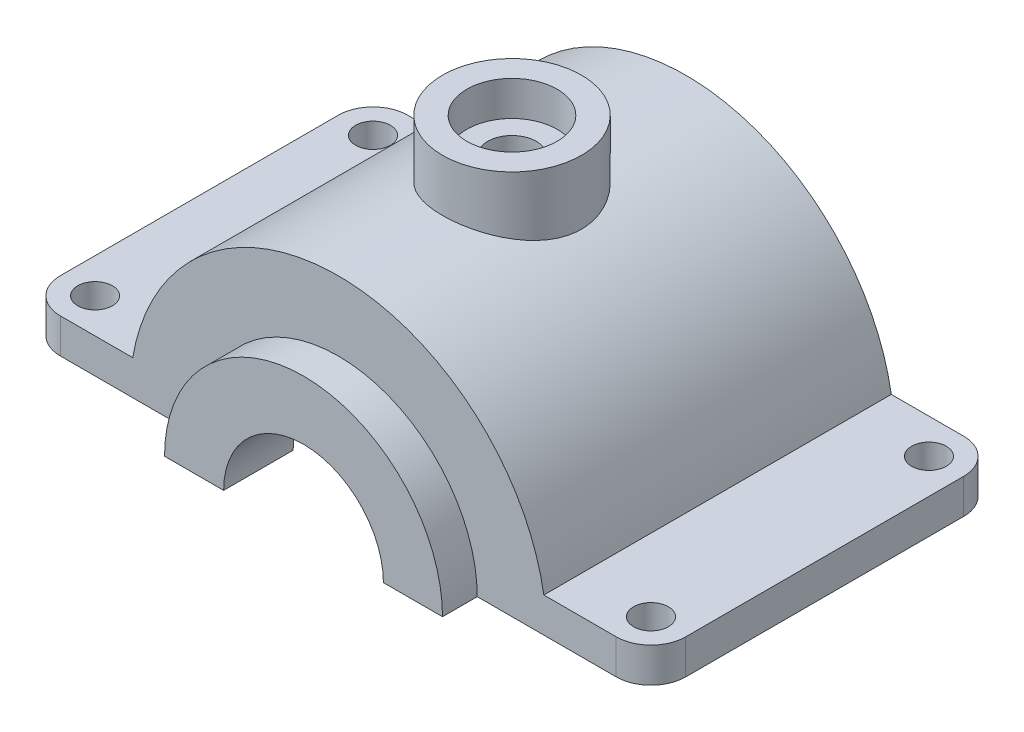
ISO-10303-21;
HEADER;
FILE_DESCRIPTION(('STEP AP214'),'2;1');
FILE_NAME('part.step','',(''),(''),'','','');
FILE_SCHEMA(('AUTOMOTIVE_DESIGN { 1 0 10303 214 1 1 1 1 }'));
ENDSEC;
DATA;
#1=APPLICATION_CONTEXT('core data for automotive mechanical design processes');
#2=APPLICATION_PROTOCOL_DEFINITION('international standard','automotive_design',2000,#1);
#3=PRODUCT_CONTEXT('',#1,'mechanical');
#4=PRODUCT('Part','Part','',(#3));
#5=PRODUCT_RELATED_PRODUCT_CATEGORY('part','',(#4));
#6=PRODUCT_DEFINITION_FORMATION('','',#4);
#7=PRODUCT_DEFINITION_CONTEXT('part definition',#1,'design');
#8=PRODUCT_DEFINITION('design','',#6,#7);
#9=PRODUCT_DEFINITION_SHAPE('','',#8);
#10=(LENGTH_UNIT() NAMED_UNIT(*) SI_UNIT(.MILLI.,.METRE.));
#11=(NAMED_UNIT(*) PLANE_ANGLE_UNIT() SI_UNIT($,.RADIAN.));
#12=(NAMED_UNIT(*) SI_UNIT($,.STERADIAN.) SOLID_ANGLE_UNIT());
#13=UNCERTAINTY_MEASURE_WITH_UNIT(LENGTH_MEASURE(1.E-05),#10,'distance_accuracy_value','');
#14=(GEOMETRIC_REPRESENTATION_CONTEXT(3) GLOBAL_UNCERTAINTY_ASSIGNED_CONTEXT((#13)) GLOBAL_UNIT_ASSIGNED_CONTEXT((#10,
#11,#12)) REPRESENTATION_CONTEXT('',''));
#15=CARTESIAN_POINT('',(0.,0.,0.));
#16=DIRECTION('',(0.,0.,1.));
#17=DIRECTION('',(1.,0.,0.));
#18=AXIS2_PLACEMENT_3D('',#15,#16,#17);
#19=CARTESIAN_POINT('',(-59.1607978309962,10.,40.));
#20=DIRECTION('',(0.,-1.,0.));
#21=DIRECTION('',(1.,0.,0.));
#22=AXIS2_PLACEMENT_3D('',#19,#20,#21);
#23=PLANE('',#22);
#24=CARTESIAN_POINT('',(-80.,10.,-40.));
#25=DIRECTION('',(0.,-1.,0.));
#26=DIRECTION('',(0.,0.,1.));
#27=AXIS2_PLACEMENT_3D('',#24,#25,#26);
#28=CIRCLE('',#27,5.00000000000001);
#29=CARTESIAN_POINT('',(-80.,10.,-35.));
#30=VERTEX_POINT('',#29);
#31=EDGE_CURVE('E522',#30,#30,#28,.T.);
#32=ORIENTED_EDGE('',*,*,#31,.T.);
#33=EDGE_LOOP('',(#32));
#34=FACE_BOUND('',#33,.T.);
#35=DIRECTION('',(0.,0.,-1.));
#36=VECTOR('',#35,1.);
#37=CARTESIAN_POINT('',(-90.,10.,40.));
#38=LINE('',#37,#36);
#39=CARTESIAN_POINT('',(-90.,10.,40.));
#40=VERTEX_POINT('',#39);
#41=CARTESIAN_POINT('',(-90.,10.,-40.));
#42=VERTEX_POINT('',#41);
#43=EDGE_CURVE('E325',#40,#42,#38,.T.);
#44=ORIENTED_EDGE('',*,*,#43,.F.);
#45=CARTESIAN_POINT('',(-80.,10.,40.));
#46=DIRECTION('',(0.,-1.,0.));
#47=DIRECTION('',(1.,0.,0.));
#48=AXIS2_PLACEMENT_3D('',#45,#46,#47);
#49=CIRCLE('',#48,10.);
#50=CARTESIAN_POINT('',(-80.,10.,50.));
#51=VERTEX_POINT('',#50);
#52=EDGE_CURVE('E235',#40,#51,#49,.F.);
#53=ORIENTED_EDGE('',*,*,#52,.T.);
#54=DIRECTION('',(-1.,0.,0.));
#55=VECTOR('',#54,1.);
#56=CARTESIAN_POINT('',(-59.1607978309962,10.,50.));
#57=LINE('',#56,#55);
#58=CARTESIAN_POINT('',(-59.1607978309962,10.,50.));
#59=VERTEX_POINT('',#58);
#60=EDGE_CURVE('E196',#59,#51,#57,.T.);
#61=ORIENTED_EDGE('',*,*,#60,.F.);
#62=DIRECTION('',(0.,0.,-1.));
#63=VECTOR('',#62,1.);
#64=CARTESIAN_POINT('',(-59.1607978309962,10.,40.));
#65=LINE('',#64,#63);
#66=CARTESIAN_POINT('',(-59.1607978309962,10.,-50.));
#67=VERTEX_POINT('',#66);
#68=EDGE_CURVE('E258',#59,#67,#65,.T.);
#69=ORIENTED_EDGE('',*,*,#68,.T.);
#70=DIRECTION('',(-1.,0.,0.));
#71=VECTOR('',#70,1.);
#72=CARTESIAN_POINT('',(-59.1607978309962,10.,-50.));
#73=LINE('',#72,#71);
#74=CARTESIAN_POINT('',(-80.,10.,-50.));
#75=VERTEX_POINT('',#74);
#76=EDGE_CURVE('E269',#67,#75,#73,.T.);
#77=ORIENTED_EDGE('',*,*,#76,.T.);
#78=CARTESIAN_POINT('',(-80.,10.,-40.));
#79=DIRECTION('',(0.,-1.,0.));
#80=DIRECTION('',(1.,0.,0.));
#81=AXIS2_PLACEMENT_3D('',#78,#79,#80);
#82=CIRCLE('',#81,10.);
#83=EDGE_CURVE('E233',#75,#42,#82,.F.);
#84=ORIENTED_EDGE('',*,*,#83,.T.);
#85=EDGE_LOOP('',(#44,#53,#61,#69,#77,#84));
#86=FACE_BOUND('',#85,.T.);
#87=CARTESIAN_POINT('',(-80.,10.,40.));
#88=DIRECTION('',(0.,-1.,0.));
#89=DIRECTION('',(0.,0.,1.));
#90=AXIS2_PLACEMENT_3D('',#87,#88,#89);
#91=CIRCLE('',#90,5.00000000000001);
#92=CARTESIAN_POINT('',(-80.,10.,45.));
#93=VERTEX_POINT('',#92);
#94=EDGE_CURVE('E527',#93,#93,#91,.T.);
#95=ORIENTED_EDGE('',*,*,#94,.T.);
#96=EDGE_LOOP('',(#95));
#97=FACE_BOUND('',#96,.T.);
#98=ADVANCED_FACE('F31',(#34,#86,#97),#23,.F.);
#99=CARTESIAN_POINT('',(-90.,0.,40.));
#100=DIRECTION('',(0.,1.,0.));
#101=DIRECTION('',(0.,0.,1.));
#102=AXIS2_PLACEMENT_3D('',#99,#100,#101);
#103=PLANE('',#102);
#104=CARTESIAN_POINT('',(-80.,0.,-40.));
#105=DIRECTION('',(0.,-1.,0.));
#106=DIRECTION('',(0.,0.,1.));
#107=AXIS2_PLACEMENT_3D('',#104,#105,#106);
#108=CIRCLE('',#107,5.00000000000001);
#109=CARTESIAN_POINT('',(-80.,0.,-35.));
#110=VERTEX_POINT('',#109);
#111=EDGE_CURVE('E519',#110,#110,#108,.T.);
#112=ORIENTED_EDGE('',*,*,#111,.F.);
#113=EDGE_LOOP('',(#112));
#114=FACE_BOUND('',#113,.T.);
#115=CARTESIAN_POINT('',(80.,0.,40.));
#116=DIRECTION('',(0.,1.,0.));
#117=DIRECTION('',(0.,0.,1.));
#118=AXIS2_PLACEMENT_3D('',#115,#116,#117);
#119=CIRCLE('',#118,5.00000000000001);
#120=CARTESIAN_POINT('',(80.,0.,45.));
#121=VERTEX_POINT('',#120);
#122=EDGE_CURVE('E513',#121,#121,#119,.T.);
#123=ORIENTED_EDGE('',*,*,#122,.T.);
#124=EDGE_LOOP('',(#123));
#125=FACE_BOUND('',#124,.T.);
#126=CARTESIAN_POINT('',(80.,0.,-40.));
#127=DIRECTION('',(0.,1.,0.));
#128=DIRECTION('',(0.,0.,1.));
#129=AXIS2_PLACEMENT_3D('',#126,#127,#128);
#130=CIRCLE('',#129,5.00000000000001);
#131=CARTESIAN_POINT('',(80.,0.,-35.));
#132=VERTEX_POINT('',#131);
#133=EDGE_CURVE('E508',#132,#132,#130,.T.);
#134=ORIENTED_EDGE('',*,*,#133,.T.);
#135=EDGE_LOOP('',(#134));
#136=FACE_BOUND('',#135,.T.);
#137=DIRECTION('',(1.,0.,0.));
#138=VECTOR('',#137,1.);
#139=CARTESIAN_POINT('',(-90.,0.,50.));
#140=LINE('',#139,#138);
#141=CARTESIAN_POINT('',(-80.,0.,50.));
#142=VERTEX_POINT('',#141);
#143=CARTESIAN_POINT('',(-40.,0.,50.));
#144=VERTEX_POINT('',#143);
#145=EDGE_CURVE('E172',#142,#144,#140,.T.);
#146=ORIENTED_EDGE('',*,*,#145,.F.);
#147=CARTESIAN_POINT('',(-80.,0.,40.));
#148=DIRECTION('',(0.,1.,0.));
#149=DIRECTION('',(0.,0.,1.));
#150=AXIS2_PLACEMENT_3D('',#147,#148,#149);
#151=CIRCLE('',#150,10.);
#152=CARTESIAN_POINT('',(-90.,0.,40.));
#153=VERTEX_POINT('',#152);
#154=EDGE_CURVE('E226',#142,#153,#151,.F.);
#155=ORIENTED_EDGE('',*,*,#154,.T.);
#156=DIRECTION('',(0.,0.,-1.));
#157=VECTOR('',#156,1.);
#158=CARTESIAN_POINT('',(-90.,0.,40.));
#159=LINE('',#158,#157);
#160=CARTESIAN_POINT('',(-90.,0.,-40.));
#161=VERTEX_POINT('',#160);
#162=EDGE_CURVE('E192',#153,#161,#159,.T.);
#163=ORIENTED_EDGE('',*,*,#162,.T.);
#164=CARTESIAN_POINT('',(-80.,0.,-40.));
#165=DIRECTION('',(0.,1.,0.));
#166=DIRECTION('',(0.,0.,1.));
#167=AXIS2_PLACEMENT_3D('',#164,#165,#166);
#168=CIRCLE('',#167,10.);
#169=CARTESIAN_POINT('',(-80.,0.,-50.));
#170=VERTEX_POINT('',#169);
#171=EDGE_CURVE('E224',#161,#170,#168,.F.);
#172=ORIENTED_EDGE('',*,*,#171,.T.);
#173=DIRECTION('',(1.,0.,0.));
#174=VECTOR('',#173,1.);
#175=CARTESIAN_POINT('',(-90.,0.,-50.));
#176=LINE('',#175,#174);
#177=CARTESIAN_POINT('',(79.9999999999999,0.,-50.));
#178=VERTEX_POINT('',#177);
#179=EDGE_CURVE('E267',#170,#178,#176,.T.);
#180=ORIENTED_EDGE('',*,*,#179,.T.);
#181=CARTESIAN_POINT('',(80.,0.,-40.));
#182=DIRECTION('',(0.,1.,0.));
#183=DIRECTION('',(0.,0.,1.));
#184=AXIS2_PLACEMENT_3D('',#181,#182,#183);
#185=CIRCLE('',#184,10.);
#186=CARTESIAN_POINT('',(90.,0.,-40.));
#187=VERTEX_POINT('',#186);
#188=EDGE_CURVE('E222',#178,#187,#185,.F.);
#189=ORIENTED_EDGE('',*,*,#188,.T.);
#190=DIRECTION('',(0.,0.,-1.));
#191=VECTOR('',#190,1.);
#192=CARTESIAN_POINT('',(90.,0.,40.));
#193=LINE('',#192,#191);
#194=CARTESIAN_POINT('',(90.,0.,40.));
#195=VERTEX_POINT('',#194);
#196=EDGE_CURVE('E250',#195,#187,#193,.T.);
#197=ORIENTED_EDGE('',*,*,#196,.F.);
#198=CARTESIAN_POINT('',(80.,0.,40.));
#199=DIRECTION('',(0.,1.,0.));
#200=DIRECTION('',(0.,0.,1.));
#201=AXIS2_PLACEMENT_3D('',#198,#199,#200);
#202=CIRCLE('',#201,10.);
#203=CARTESIAN_POINT('',(79.9999999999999,0.,50.));
#204=VERTEX_POINT('',#203);
#205=EDGE_CURVE('E220',#195,#204,#202,.F.);
#206=ORIENTED_EDGE('',*,*,#205,.T.);
#207=CARTESIAN_POINT('',(40.,0.,50.));
#208=VERTEX_POINT('',#207);
#209=EDGE_CURVE('E169',#208,#204,#140,.T.);
#210=ORIENTED_EDGE('',*,*,#209,.F.);
#211=DIRECTION('',(0.,0.,-1.));
#212=VECTOR('',#211,1.);
#213=CARTESIAN_POINT('',(40.,0.,60.));
#214=LINE('',#213,#212);
#215=CARTESIAN_POINT('',(40.,0.,60.));
#216=VERTEX_POINT('',#215);
#217=EDGE_CURVE('E272',#216,#208,#214,.T.);
#218=ORIENTED_EDGE('',*,*,#217,.F.);
#219=DIRECTION('',(1.,0.,0.));
#220=VECTOR('',#219,1.);
#221=CARTESIAN_POINT('',(-40.,0.,60.));
#222=LINE('',#221,#220);
#223=CARTESIAN_POINT('',(22.9885129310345,0.,60.));
#224=VERTEX_POINT('',#223);
#225=EDGE_CURVE('E281',#224,#216,#222,.T.);
#226=ORIENTED_EDGE('',*,*,#225,.F.);
#227=DIRECTION('',(0.,0.,1.));
#228=VECTOR('',#227,1.);
#229=CARTESIAN_POINT('',(22.9885129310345,0.,40.));
#230=LINE('',#229,#228);
#231=CARTESIAN_POINT('',(22.9885129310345,0.,40.));
#232=VERTEX_POINT('',#231);
#233=EDGE_CURVE('E152',#232,#224,#230,.T.);
#234=ORIENTED_EDGE('',*,*,#233,.F.);
#235=DIRECTION('',(1.,0.,0.));
#236=VECTOR('',#235,1.);
#237=CARTESIAN_POINT('',(-90.,0.,40.));
#238=LINE('',#237,#236);
#239=CARTESIAN_POINT('',(49.9999999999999,0.,40.));
#240=VERTEX_POINT('',#239);
#241=EDGE_CURVE('E160',#232,#240,#238,.T.);
#242=ORIENTED_EDGE('',*,*,#241,.T.);
#243=DIRECTION('',(0.,0.,-1.));
#244=VECTOR('',#243,1.);
#245=CARTESIAN_POINT('',(50.,0.,40.));
#246=LINE('',#245,#244);
#247=CARTESIAN_POINT('',(50.,0.,-40.));
#248=VERTEX_POINT('',#247);
#249=EDGE_CURVE('E217',#240,#248,#246,.T.);
#250=ORIENTED_EDGE('',*,*,#249,.T.);
#251=DIRECTION('',(1.,0.,0.));
#252=VECTOR('',#251,1.);
#253=CARTESIAN_POINT('',(-90.,0.,-40.));
#254=LINE('',#253,#252);
#255=CARTESIAN_POINT('',(-50.,0.,-40.));
#256=VERTEX_POINT('',#255);
#257=EDGE_CURVE('E204',#256,#248,#254,.T.);
#258=ORIENTED_EDGE('',*,*,#257,.F.);
#259=DIRECTION('',(0.,0.,-1.));
#260=VECTOR('',#259,1.);
#261=CARTESIAN_POINT('',(-50.,0.,40.));
#262=LINE('',#261,#260);
#263=CARTESIAN_POINT('',(-50.,0.,40.));
#264=VERTEX_POINT('',#263);
#265=EDGE_CURVE('E167',#264,#256,#262,.T.);
#266=ORIENTED_EDGE('',*,*,#265,.F.);
#267=CARTESIAN_POINT('',(-22.9885129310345,0.,40.));
#268=VERTEX_POINT('',#267);
#269=EDGE_CURVE('E159',#264,#268,#238,.T.);
#270=ORIENTED_EDGE('',*,*,#269,.T.);
#271=DIRECTION('',(0.,0.,1.));
#272=VECTOR('',#271,1.);
#273=CARTESIAN_POINT('',(-22.9885129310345,0.,40.));
#274=LINE('',#273,#272);
#275=CARTESIAN_POINT('',(-22.9885129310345,0.,60.));
#276=VERTEX_POINT('',#275);
#277=EDGE_CURVE('E142',#268,#276,#274,.T.);
#278=ORIENTED_EDGE('',*,*,#277,.T.);
#279=CARTESIAN_POINT('',(-40.,0.,60.));
#280=VERTEX_POINT('',#279);
#281=EDGE_CURVE('E276',#280,#276,#222,.T.);
#282=ORIENTED_EDGE('',*,*,#281,.F.);
#283=DIRECTION('',(0.,0.,-1.));
#284=VECTOR('',#283,1.);
#285=CARTESIAN_POINT('',(-40.,0.,60.));
#286=LINE('',#285,#284);
#287=EDGE_CURVE('E199',#280,#144,#286,.T.);
#288=ORIENTED_EDGE('',*,*,#287,.T.);
#289=EDGE_LOOP('',(#146,#155,#163,#172,#180,#189,#197,#206,#210,#218,#226,#234,#242,#250,#258,
#266,#270,#278,#282,#288));
#290=FACE_BOUND('',#289,.T.);
#291=CARTESIAN_POINT('',(-80.,0.,40.));
#292=DIRECTION('',(0.,-1.,0.));
#293=DIRECTION('',(0.,0.,1.));
#294=AXIS2_PLACEMENT_3D('',#291,#292,#293);
#295=CIRCLE('',#294,5.00000000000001);
#296=CARTESIAN_POINT('',(-80.,0.,45.));
#297=VERTEX_POINT('',#296);
#298=EDGE_CURVE('E524',#297,#297,#295,.T.);
#299=ORIENTED_EDGE('',*,*,#298,.F.);
#300=EDGE_LOOP('',(#299));
#301=FACE_BOUND('',#300,.T.);
#302=ADVANCED_FACE('F163',(#114,#125,#136,#290,#301),#103,.F.);
#303=CARTESIAN_POINT('',(0.,-5.00000000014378E-05,0.));
#304=DIRECTION('',(0.,1.,0.));
#305=DIRECTION('',(0.,0.,1.));
#306=AXIS2_PLACEMENT_3D('',#303,#304,#305);
#307=CYLINDRICAL_SURFACE('',#306,7.);
#308=CARTESIAN_POINT('',(0.,50.,7.));
#309=CARTESIAN_POINT('',(0.195638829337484,50.0000009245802,7.00000248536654));
#310=CARTESIAN_POINT('',(0.391242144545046,49.9988495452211,6.99179550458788));
#311=CARTESIAN_POINT('',(0.78110944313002,49.9942781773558,6.95903213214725));
#312=CARTESIAN_POINT('',(0.975373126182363,49.9908576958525,6.93447218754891));
#313=CARTESIAN_POINT('',(1.36124353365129,49.9818396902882,6.8691585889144));
#314=CARTESIAN_POINT('',(1.55284827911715,49.9762406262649,6.82839347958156));
#315=CARTESIAN_POINT('',(1.93197426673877,49.9630209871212,6.73095797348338));
#316=CARTESIAN_POINT('',(2.11949398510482,49.9553996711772,6.67428174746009));
#317=CARTESIAN_POINT('',(2.4888492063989,49.9383597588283,6.54552056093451));
#318=CARTESIAN_POINT('',(2.6706907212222,49.9289431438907,6.47345257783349));
#319=CARTESIAN_POINT('',(3.02770203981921,49.9085664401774,6.31436662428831));
#320=CARTESIAN_POINT('',(3.20286935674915,49.8976057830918,6.22734314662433));
#321=CARTESIAN_POINT('',(3.54515750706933,49.8744551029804,6.03903910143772));
#322=CARTESIAN_POINT('',(3.7122825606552,49.8622657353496,5.93776612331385));
#323=CARTESIAN_POINT('',(4.0374982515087,49.8369865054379,5.72160338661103));
#324=CARTESIAN_POINT('',(4.19558550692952,49.8238963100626,5.60670857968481));
#325=CARTESIAN_POINT('',(4.50245721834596,49.7971057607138,5.36343517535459));
#326=CARTESIAN_POINT('',(4.65118296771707,49.7834023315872,5.23498285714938));
#327=CARTESIAN_POINT('',(4.93735797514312,49.7558355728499,4.96599173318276));
#328=CARTESIAN_POINT('',(5.07480304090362,49.7419721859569,4.82544847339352));
#329=CARTESIAN_POINT('',(5.33736006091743,49.7144849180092,4.53333667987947));
#330=CARTESIAN_POINT('',(5.46247585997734,49.700860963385,4.38177160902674));
#331=CARTESIAN_POINT('',(5.69959182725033,49.6742276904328,4.06856832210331));
#332=CARTESIAN_POINT('',(5.81158714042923,49.6612186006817,3.90692641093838));
#333=CARTESIAN_POINT('',(6.02202667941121,49.6361408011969,3.57408852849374));
#334=CARTESIAN_POINT('',(6.12041625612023,49.6240759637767,3.40285769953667));
#335=CARTESIAN_POINT('',(6.30244599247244,49.6012861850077,3.05256587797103));
#336=CARTESIAN_POINT('',(6.38608065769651,49.5905617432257,2.87350199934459));
#337=CARTESIAN_POINT('',(6.53791022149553,49.5707737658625,2.50891936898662));
#338=CARTESIAN_POINT('',(6.60611139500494,49.5617095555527,2.32340327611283));
#339=CARTESIAN_POINT('',(6.72662819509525,49.5454953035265,1.9472003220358));
#340=CARTESIAN_POINT('',(6.77893799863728,49.538345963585,1.75651159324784));
#341=CARTESIAN_POINT('',(6.91073183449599,49.5201992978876,1.18124068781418));
#342=CARTESIAN_POINT('',(6.96624851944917,49.5123457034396,0.790640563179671));
#343=CARTESIAN_POINT('',(6.99984386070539,49.5075961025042,0.202492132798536));
#344=CARTESIAN_POINT('',(7.00275310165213,49.5071860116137,0.00598467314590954));
#345=CARTESIAN_POINT('',(6.99207217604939,49.508695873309,-0.386596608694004));
#346=CARTESIAN_POINT('',(6.97848168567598,49.5106158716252,-0.582670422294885));
#347=CARTESIAN_POINT('',(6.91331822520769,49.519777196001,-1.16518744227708));
#348=CARTESIAN_POINT('',(6.83753189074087,49.5303953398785,-1.5491448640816));
#349=CARTESIAN_POINT('',(6.6233207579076,49.5594903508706,-2.29863969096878));
#350=CARTESIAN_POINT('',(6.48489439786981,49.5779674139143,-2.66417663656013));
#351=CARTESIAN_POINT('',(6.14882755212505,49.6207678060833,-3.3681588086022));
#352=CARTESIAN_POINT('',(5.95098486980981,49.64511104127,-3.70650644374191));
#353=CARTESIAN_POINT('',(5.50184755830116,49.6968872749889,-4.34536472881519));
#354=CARTESIAN_POINT('',(5.25054986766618,49.724320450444,-4.6458732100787));
#355=CARTESIAN_POINT('',(4.69903291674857,49.7794774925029,-5.20327972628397));
#356=CARTESIAN_POINT('',(4.39840722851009,49.8072018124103,-5.45977579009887));
#357=CARTESIAN_POINT('',(3.75815922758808,49.8595951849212,-5.9187313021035));
#358=CARTESIAN_POINT('',(3.41853678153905,49.8842642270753,-6.12119056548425));
#359=CARTESIAN_POINT('',(2.70960361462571,49.9277886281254,-6.46633879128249));
#360=CARTESIAN_POINT('',(2.3402788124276,49.9466412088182,-6.60899920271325));
#361=CARTESIAN_POINT('',(1.58259214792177,49.9763845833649,-6.83016310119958));
#362=CARTESIAN_POINT('',(1.19423140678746,49.9872758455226,-6.90867036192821));
#363=CARTESIAN_POINT('',(0.412969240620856,49.9998079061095,-6.99877069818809));
#364=CARTESIAN_POINT('',(0.020132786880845,50.0015251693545,-7.01091690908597));
#365=CARTESIAN_POINT('',(-0.761970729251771,49.995723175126,-6.96941486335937));
#366=CARTESIAN_POINT('',(-1.15123788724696,49.988204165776,-6.91576837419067));
#367=CARTESIAN_POINT('',(-1.91349564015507,49.9648218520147,-6.74466393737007));
#368=CARTESIAN_POINT('',(-2.28654734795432,49.9489934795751,-6.62747305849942));
#369=CARTESIAN_POINT('',(-3.00770592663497,49.9107625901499,-6.33288504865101));
#370=CARTESIAN_POINT('',(-3.35581175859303,49.8883597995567,-6.15548541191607));
#371=CARTESIAN_POINT('',(-4.01964424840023,49.8392825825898,-5.74420597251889));
#372=CARTESIAN_POINT('',(-4.33514971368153,49.8125817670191,-5.50997239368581));
#373=CARTESIAN_POINT('',(-4.92257186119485,49.7579690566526,-4.99215078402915));
#374=CARTESIAN_POINT('',(-5.19448635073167,49.7300571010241,-4.70856027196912));
#375=CARTESIAN_POINT('',(-5.68898166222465,49.6759292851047,-4.09769507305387));
#376=CARTESIAN_POINT('',(-5.9111932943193,49.6497270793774,-3.7701206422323));
#377=CARTESIAN_POINT('',(-6.29748349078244,49.6022160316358,-3.08175582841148));
#378=CARTESIAN_POINT('',(-6.46156346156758,49.5809070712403,-2.72096624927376));
#379=CARTESIAN_POINT('',(-6.66014166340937,49.5544833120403,-2.16366699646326));
#380=CARTESIAN_POINT('',(-6.71837433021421,49.5466040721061,-1.97542170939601));
#381=CARTESIAN_POINT('',(-6.81878408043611,49.5328859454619,-1.59464022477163));
#382=CARTESIAN_POINT('',(-6.86096687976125,49.5270463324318,-1.40210558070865));
#383=CARTESIAN_POINT('',(-6.928955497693,49.5175801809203,-1.01409822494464));
#384=CARTESIAN_POINT('',(-6.95475903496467,49.5139539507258,-0.818625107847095));
#385=CARTESIAN_POINT('',(-6.98979120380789,49.5090207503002,-0.426171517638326));
#386=CARTESIAN_POINT('',(-6.99902032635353,49.5077137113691,-0.229191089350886));
#387=CARTESIAN_POINT('',(-7.0008238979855,49.5074586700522,0.163125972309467));
#388=CARTESIAN_POINT('',(-6.99354297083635,49.5084901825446,0.358461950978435));
#389=CARTESIAN_POINT('',(-6.96267984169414,49.5128400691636,0.74781324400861));
#390=CARTESIAN_POINT('',(-6.93909791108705,49.5161584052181,0.941828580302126));
#391=CARTESIAN_POINT('',(-6.87580456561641,49.5249869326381,1.32719534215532));
#392=CARTESIAN_POINT('',(-6.83609019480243,49.5304975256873,1.51854627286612));
#393=CARTESIAN_POINT('',(-6.74084572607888,49.5435495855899,1.89712511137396));
#394=CARTESIAN_POINT('',(-6.68532136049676,49.5510903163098,2.08435448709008));
#395=CARTESIAN_POINT('',(-6.55887412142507,49.5679859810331,2.45340774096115));
#396=CARTESIAN_POINT('',(-6.48795462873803,49.5773405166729,2.63523279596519));
#397=CARTESIAN_POINT('',(-6.3312531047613,49.5975953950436,2.99219228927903));
#398=CARTESIAN_POINT('',(-6.24547644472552,49.6084951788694,3.16732911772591));
#399=CARTESIAN_POINT('',(-6.0596202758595,49.6315400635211,3.50984054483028));
#400=CARTESIAN_POINT('',(-5.95953540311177,49.6436856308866,3.67721220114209));
#401=CARTESIAN_POINT('',(-5.74582967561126,49.6688736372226,4.0029198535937));
#402=CARTESIAN_POINT('',(-5.63221365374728,49.6819157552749,4.16125904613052));
#403=CARTESIAN_POINT('',(-5.39115326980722,49.7086541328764,4.46923251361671));
#404=CARTESIAN_POINT('',(-5.26359657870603,49.7223551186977,4.61877846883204));
#405=CARTESIAN_POINT('',(-4.99642076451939,49.7499125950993,4.90655848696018));
#406=CARTESIAN_POINT('',(-4.85680601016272,49.76376902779,5.04479661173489));
#407=CARTESIAN_POINT('',(-4.56635421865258,49.7912612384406,5.30914231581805));
#408=CARTESIAN_POINT('',(-4.41551048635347,49.804896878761,5.43524255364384));
#409=CARTESIAN_POINT('',(-4.10377682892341,49.831550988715,5.67429135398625));
#410=CARTESIAN_POINT('',(-3.94289063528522,49.8445696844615,5.78724475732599));
#411=CARTESIAN_POINT('',(-3.61128195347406,49.8696944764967,5.999802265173));
#412=CARTESIAN_POINT('',(-3.44051303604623,49.8817955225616,6.09933455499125));
#413=CARTESIAN_POINT('',(-3.09116672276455,49.9046622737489,6.28360368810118));
#414=CARTESIAN_POINT('',(-2.91259222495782,49.9154284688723,6.36834596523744));
#415=CARTESIAN_POINT('',(-2.54897162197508,49.9353167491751,6.52239956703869));
#416=CARTESIAN_POINT('',(-2.36393050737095,49.9444400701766,6.59172249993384));
#417=CARTESIAN_POINT('',(-1.98863631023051,49.9607908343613,6.71448515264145));
#418=CARTESIAN_POINT('',(-1.7983844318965,49.9680187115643,6.76792850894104));
#419=CARTESIAN_POINT('',(-1.34338005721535,49.9826402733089,6.87518483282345));
#420=CARTESIAN_POINT('',(-1.07690265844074,49.989121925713,6.92193999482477));
#421=CARTESIAN_POINT('',(-0.54026091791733,49.997801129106,6.98434570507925));
#422=CARTESIAN_POINT('',(-0.270096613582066,49.9999987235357,6.99999656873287));
#423=CARTESIAN_POINT('',(0.,50.,7.));
#424=B_SPLINE_CURVE_WITH_KNOTS('',3,(#308,#309,#310,#311,#312,#313,#314,#315,#316,#317,#318,
#319,#320,#321,#322,#323,#324,#325,#326,#327,#328,#329,#330,#331,#332,#333,#334,#335,#336,#337,
#338,#339,#340,#341,#342,#343,#344,#345,#346,#347,#348,#349,#350,#351,#352,#353,#354,#355,#356,
#357,#358,#359,#360,#361,#362,#363,#364,#365,#366,#367,#368,#369,#370,#371,#372,#373,#374,#375,
#376,#377,#378,#379,#380,#381,#382,#383,#384,#385,#386,#387,#388,#389,#390,#391,#392,#393,#394,
#395,#396,#397,#398,#399,#400,#401,#402,#403,#404,#405,#406,#407,#408,#409,#410,#411,#412,#413,
#414,#415,#416,#417,#418,#419,#420,#421,#422,#423),.UNSPECIFIED.,.T.,.F.,(4,2,2,2,2,2,2,2,2,2,2,
2,2,2,2,2,2,2,2,2,2,2,2,2,2,2,2,2,2,2,2,2,2,2,2,2,2,2,2,2,2,2,2,2,2,2,2,2,2,2,2,2,2,2,2,2,2,4),
(0.,0.586680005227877,1.1734875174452,1.76071057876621,2.34814905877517,2.93494289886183,
3.52195328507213,4.10865220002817,4.69556923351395,5.28586044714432,5.87637004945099,
6.46669491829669,7.05723754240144,7.65008722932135,8.24315721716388,8.83598564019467,
9.4290310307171,10.6060829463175,11.1951054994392,11.7841396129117,12.9526616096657,
14.1212127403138,15.29378645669,16.4664273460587,17.6492657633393,18.8321082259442,
20.0155147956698,21.1988517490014,22.3723100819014,23.5457368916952,24.7142697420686,
25.8828512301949,27.0589023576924,28.2350126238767,29.419588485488,30.6041356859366,
31.1951642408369,31.7859821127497,32.3768822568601,32.9677648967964,33.5534915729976,
34.1392084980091,34.7250327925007,35.3106449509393,35.8961286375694,36.4814010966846,
37.0668935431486,37.6521774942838,38.2425841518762,38.8327777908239,39.4233261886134,
40.0136564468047,40.6070297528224,41.2001845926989,41.792891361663,42.3854622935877,
43.1954338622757,44.0053972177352),.UNSPECIFIED.);
#425=CARTESIAN_POINT('',(0.,50.,7.));
#426=VERTEX_POINT('',#425);
#427=EDGE_CURVE('E371',#426,#426,#424,.T.);
#428=ORIENTED_EDGE('',*,*,#427,.F.);
#429=EDGE_LOOP('',(#428));
#430=FACE_BOUND('',#429,.T.);
#431=CARTESIAN_POINT('',(0.,65.,0.));
#432=DIRECTION('',(0.,1.,0.));
#433=DIRECTION('',(0.,0.,1.));
#434=AXIS2_PLACEMENT_3D('',#431,#432,#433);
#435=CIRCLE('',#434,7.);
#436=CARTESIAN_POINT('',(0.,65.,7.));
#437=VERTEX_POINT('',#436);
#438=EDGE_CURVE('E212',#437,#437,#435,.F.);
#439=ORIENTED_EDGE('',*,*,#438,.F.);
#440=EDGE_LOOP('',(#439));
#441=FACE_BOUND('',#440,.T.);
#442=ADVANCED_FACE('F352',(#430,#441),#307,.F.);
#443=CARTESIAN_POINT('',(0.,0.,40.));
#444=DIRECTION('',(0.,0.,-1.));
#445=DIRECTION('',(-1.,0.,0.));
#446=AXIS2_PLACEMENT_3D('',#443,#444,#445);
#447=CYLINDRICAL_SURFACE('',#446,50.);
#448=ORIENTED_EDGE('',*,*,#427,.T.);
#449=EDGE_LOOP('',(#448));
#450=FACE_BOUND('',#449,.T.);
#451=CARTESIAN_POINT('',(0.,0.,-40.));
#452=DIRECTION('',(0.,0.,-1.));
#453=DIRECTION('',(-1.,0.,0.));
#454=AXIS2_PLACEMENT_3D('',#451,#452,#453);
#455=CIRCLE('',#454,50.);
#456=EDGE_CURVE('E188',#256,#248,#455,.T.);
#457=ORIENTED_EDGE('',*,*,#456,.T.);
#458=ORIENTED_EDGE('',*,*,#249,.F.);
#459=CARTESIAN_POINT('',(0.,0.,40.));
#460=DIRECTION('',(0.,0.,-1.));
#461=DIRECTION('',(-1.,0.,0.));
#462=AXIS2_PLACEMENT_3D('',#459,#460,#461);
#463=CIRCLE('',#462,50.);
#464=EDGE_CURVE('E185',#264,#240,#463,.T.);
#465=ORIENTED_EDGE('',*,*,#464,.F.);
#466=ORIENTED_EDGE('',*,*,#265,.T.);
#467=EDGE_LOOP('',(#457,#458,#465,#466));
#468=FACE_BOUND('',#467,.T.);
#469=ADVANCED_FACE('F264',(#450,#468),#447,.F.);
#470=CARTESIAN_POINT('',(90.,10.,40.));
#471=DIRECTION('',(-1.,0.,0.));
#472=DIRECTION('',(0.,0.,1.));
#473=AXIS2_PLACEMENT_3D('',#470,#471,#472);
#474=PLANE('',#473);
#475=ORIENTED_EDGE('',*,*,#196,.T.);
#476=DIRECTION('',(0.,1.,0.));
#477=VECTOR('',#476,1.);
#478=CARTESIAN_POINT('',(90.,10.,-40.));
#479=LINE('',#478,#477);
#480=CARTESIAN_POINT('',(90.,10.,-40.));
#481=VERTEX_POINT('',#480);
#482=EDGE_CURVE('E243',#187,#481,#479,.T.);
#483=ORIENTED_EDGE('',*,*,#482,.T.);
#484=DIRECTION('',(0.,0.,-1.));
#485=VECTOR('',#484,1.);
#486=CARTESIAN_POINT('',(90.,10.,40.));
#487=LINE('',#486,#485);
#488=CARTESIAN_POINT('',(90.,10.,40.));
#489=VERTEX_POINT('',#488);
#490=EDGE_CURVE('E247',#489,#481,#487,.T.);
#491=ORIENTED_EDGE('',*,*,#490,.F.);
#492=DIRECTION('',(0.,1.,0.));
#493=VECTOR('',#492,1.);
#494=CARTESIAN_POINT('',(90.,0.,40.));
#495=LINE('',#494,#493);
#496=EDGE_CURVE('E241',#489,#195,#495,.F.);
#497=ORIENTED_EDGE('',*,*,#496,.T.);
#498=EDGE_LOOP('',(#475,#483,#491,#497));
#499=FACE_BOUND('',#498,.T.);
#500=ADVANCED_FACE('F246',(#499),#474,.F.);
#501=CARTESIAN_POINT('',(59.1607978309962,10.,40.));
#502=DIRECTION('',(0.,-1.,0.));
#503=DIRECTION('',(0.,0.,-1.));
#504=AXIS2_PLACEMENT_3D('',#501,#502,#503);
#505=PLANE('',#504);
#506=CARTESIAN_POINT('',(80.,10.,40.));
#507=DIRECTION('',(0.,1.,0.));
#508=DIRECTION('',(0.,0.,1.));
#509=AXIS2_PLACEMENT_3D('',#506,#507,#508);
#510=CIRCLE('',#509,5.00000000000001);
#511=CARTESIAN_POINT('',(80.,10.,45.));
#512=VERTEX_POINT('',#511);
#513=EDGE_CURVE('E516',#512,#512,#510,.T.);
#514=ORIENTED_EDGE('',*,*,#513,.F.);
#515=EDGE_LOOP('',(#514));
#516=FACE_BOUND('',#515,.T.);
#517=CARTESIAN_POINT('',(80.,10.,-40.));
#518=DIRECTION('',(0.,1.,0.));
#519=DIRECTION('',(0.,0.,1.));
#520=AXIS2_PLACEMENT_3D('',#517,#518,#519);
#521=CIRCLE('',#520,5.00000000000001);
#522=CARTESIAN_POINT('',(80.,10.,-35.));
#523=VERTEX_POINT('',#522);
#524=EDGE_CURVE('E510',#523,#523,#521,.T.);
#525=ORIENTED_EDGE('',*,*,#524,.F.);
#526=EDGE_LOOP('',(#525));
#527=FACE_BOUND('',#526,.T.);
#528=ORIENTED_EDGE('',*,*,#490,.T.);
#529=CARTESIAN_POINT('',(80.,10.,-40.));
#530=DIRECTION('',(0.,-1.,0.));
#531=DIRECTION('',(0.,0.,-1.));
#532=AXIS2_PLACEMENT_3D('',#529,#530,#531);
#533=CIRCLE('',#532,10.);
#534=CARTESIAN_POINT('',(80.,10.,-50.));
#535=VERTEX_POINT('',#534);
#536=EDGE_CURVE('E11',#481,#535,#533,.F.);
#537=ORIENTED_EDGE('',*,*,#536,.T.);
#538=DIRECTION('',(-1.,0.,0.));
#539=VECTOR('',#538,1.);
#540=CARTESIAN_POINT('',(90.,10.,-50.));
#541=LINE('',#540,#539);
#542=CARTESIAN_POINT('',(59.1607978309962,10.,-50.));
#543=VERTEX_POINT('',#542);
#544=EDGE_CURVE('E174',#535,#543,#541,.T.);
#545=ORIENTED_EDGE('',*,*,#544,.T.);
#546=DIRECTION('',(0.,0.,-1.));
#547=VECTOR('',#546,1.);
#548=CARTESIAN_POINT('',(59.1607978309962,10.,40.));
#549=LINE('',#548,#547);
#550=CARTESIAN_POINT('',(59.1607978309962,10.,50.));
#551=VERTEX_POINT('',#550);
#552=EDGE_CURVE('E254',#551,#543,#549,.T.);
#553=ORIENTED_EDGE('',*,*,#552,.F.);
#554=DIRECTION('',(-1.,0.,0.));
#555=VECTOR('',#554,1.);
#556=CARTESIAN_POINT('',(90.,10.,50.));
#557=LINE('',#556,#555);
#558=CARTESIAN_POINT('',(80.,10.,50.));
#559=VERTEX_POINT('',#558);
#560=EDGE_CURVE('E206',#559,#551,#557,.T.);
#561=ORIENTED_EDGE('',*,*,#560,.F.);
#562=CARTESIAN_POINT('',(80.,10.,40.));
#563=DIRECTION('',(0.,-1.,0.));
#564=DIRECTION('',(0.,0.,-1.));
#565=AXIS2_PLACEMENT_3D('',#562,#563,#564);
#566=CIRCLE('',#565,10.);
#567=EDGE_CURVE('E39',#559,#489,#566,.F.);
#568=ORIENTED_EDGE('',*,*,#567,.T.);
#569=EDGE_LOOP('',(#528,#537,#545,#553,#561,#568));
#570=FACE_BOUND('',#569,.T.);
#571=ADVANCED_FACE('F252',(#516,#527,#570),#505,.F.);
#572=CARTESIAN_POINT('',(0.,0.,40.));
#573=DIRECTION('',(0.,0.,-1.));
#574=DIRECTION('',(-1.,0.,0.));
#575=AXIS2_PLACEMENT_3D('',#572,#573,#574);
#576=CYLINDRICAL_SURFACE('',#575,60.);
#577=CARTESIAN_POINT('',(0.,60.,20.));
#578=CARTESIAN_POINT('',(0.545634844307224,60.0000001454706,20.0000002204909));
#579=CARTESIAN_POINT('',(1.09126643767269,59.9925400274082,19.9776533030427));
#580=CARTESIAN_POINT('',(2.1784725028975,59.9629050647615,19.8884827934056));
#581=CARTESIAN_POINT('',(2.72004700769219,59.940730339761,19.8216595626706));
#582=CARTESIAN_POINT('',(3.79522225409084,59.8822693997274,19.6441644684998));
#583=CARTESIAN_POINT('',(4.32882237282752,59.8459820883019,19.5334891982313));
#584=CARTESIAN_POINT('',(5.38422365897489,59.7602750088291,19.2693037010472));
#585=CARTESIAN_POINT('',(5.90602474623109,59.7108551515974,19.1157931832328));
#586=CARTESIAN_POINT('',(6.93339054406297,59.6002902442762,18.7675727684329));
#587=CARTESIAN_POINT('',(7.43898155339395,59.5391654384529,18.572933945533));
#588=CARTESIAN_POINT('',(8.43159263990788,59.4067250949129,18.1438861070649));
#589=CARTESIAN_POINT('',(8.91861276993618,59.3354095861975,17.909477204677));
#590=CARTESIAN_POINT('',(9.87116412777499,59.1843958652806,17.4026210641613));
#591=CARTESIAN_POINT('',(10.3366922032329,59.1046964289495,17.1301682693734));
#592=CARTESIAN_POINT('',(11.2434357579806,58.9389314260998,16.5491737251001));
#593=CARTESIAN_POINT('',(11.6846506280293,58.8528657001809,16.2406310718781));
#594=CARTESIAN_POINT('',(12.5536727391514,58.6737434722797,15.5792362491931));
#595=CARTESIAN_POINT('',(12.9806312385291,58.5805526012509,15.2253014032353));
#596=CARTESIAN_POINT('',(13.5976369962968,58.4392749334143,14.6690494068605));
#597=CARTESIAN_POINT('',(13.7994103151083,58.3919312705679,14.4793964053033));
#598=CARTESIAN_POINT('',(14.1949394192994,58.2970415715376,14.0918545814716));
#599=CARTESIAN_POINT('',(14.3886932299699,58.2494954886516,13.8939637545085));
#600=CARTESIAN_POINT('',(14.9574114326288,58.1070440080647,13.2884337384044));
#601=CARTESIAN_POINT('',(15.3198802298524,58.0123143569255,12.8688940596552));
#602=CARTESIAN_POINT('',(16.0090370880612,57.8259303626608,12.0007448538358));
#603=CARTESIAN_POINT('',(16.3357253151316,57.7342760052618,11.5521354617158));
#604=CARTESIAN_POINT('',(16.8017031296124,57.5997389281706,10.8528483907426));
#605=CARTESIAN_POINT('',(16.9549834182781,57.5547775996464,10.6117939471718));
#606=CARTESIAN_POINT('',(17.2511816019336,57.466691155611,10.1231590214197));
#607=CARTESIAN_POINT('',(17.3941019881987,57.4235655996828,9.87558012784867));
#608=CARTESIAN_POINT('',(17.8069833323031,57.29741931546,9.12350462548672));
#609=CARTESIAN_POINT('',(18.0610913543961,57.2176211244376,8.60962887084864));
#610=CARTESIAN_POINT('',(18.5246696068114,57.0692201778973,7.56077912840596));
#611=CARTESIAN_POINT('',(18.7341504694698,57.0006147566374,7.02581020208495));
#612=CARTESIAN_POINT('',(19.1066860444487,56.8768241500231,5.93841333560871));
#613=CARTESIAN_POINT('',(19.2697428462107,56.8216383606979,5.38598618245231));
#614=CARTESIAN_POINT('',(19.5431287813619,56.7281789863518,4.28672650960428));
#615=CARTESIAN_POINT('',(19.655049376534,56.6893982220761,3.74033262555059));
#616=CARTESIAN_POINT('',(19.8329376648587,56.6274093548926,2.63923471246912));
#617=CARTESIAN_POINT('',(19.898906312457,56.6042009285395,2.08453085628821));
#618=CARTESIAN_POINT('',(19.9842000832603,56.5741442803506,0.971254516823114));
#619=CARTESIAN_POINT('',(20.003537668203,56.5672916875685,0.41268310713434));
#620=CARTESIAN_POINT('',(19.9954010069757,56.5701685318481,-0.704067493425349));
#621=CARTESIAN_POINT('',(19.9679280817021,56.5798975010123,-1.26224669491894));
#622=CARTESIAN_POINT('',(19.8687904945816,56.6147837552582,-2.34836289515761));
#623=CARTESIAN_POINT('',(19.7992060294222,56.6392145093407,-2.8765147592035));
#624=CARTESIAN_POINT('',(19.6183370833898,56.7021164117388,-3.92475680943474));
#625=CARTESIAN_POINT('',(19.5070540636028,56.7405870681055,-4.4448472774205));
#626=CARTESIAN_POINT('',(19.2437680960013,56.8304205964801,-5.47350853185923));
#627=CARTESIAN_POINT('',(19.0917617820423,56.8817845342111,-5.98207836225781));
#628=CARTESIAN_POINT('',(18.7483026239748,56.9959109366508,-6.98439863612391));
#629=CARTESIAN_POINT('',(18.556848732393,57.0586737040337,-7.47814868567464));
#630=CARTESIAN_POINT('',(18.1325971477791,57.1949239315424,-8.45560897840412));
#631=CARTESIAN_POINT('',(17.899184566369,57.2685675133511,-8.93903042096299));
#632=CARTESIAN_POINT('',(17.3948917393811,57.4237520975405,-9.88457650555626));
#633=CARTESIAN_POINT('',(17.1240113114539,57.5052931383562,-10.3467010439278));
#634=CARTESIAN_POINT('',(16.5465502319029,57.6741029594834,-11.247124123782));
#635=CARTESIAN_POINT('',(16.2399611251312,57.7613730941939,-11.6854169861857));
#636=CARTESIAN_POINT('',(15.5930570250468,57.9393570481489,-12.5356266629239));
#637=CARTESIAN_POINT('',(15.2527408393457,58.0300709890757,-12.9475425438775));
#638=CARTESIAN_POINT('',(14.5217686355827,58.2174190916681,-13.7634919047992));
#639=CARTESIAN_POINT('',(14.1294114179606,58.3141149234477,-14.165988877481));
#640=CARTESIAN_POINT('',(13.3120335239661,58.5061191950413,-14.9367103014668));
#641=CARTESIAN_POINT('',(12.8870117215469,58.6014275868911,-15.3049335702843));
#642=CARTESIAN_POINT('',(12.0068804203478,58.7880699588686,-16.0047156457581));
#643=CARTESIAN_POINT('',(11.5517677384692,58.879403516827,-16.3362705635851));
#644=CARTESIAN_POINT('',(10.6143261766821,59.055596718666,-16.9603400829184));
#645=CARTESIAN_POINT('',(10.1319974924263,59.1404564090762,-17.2528549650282));
#646=CARTESIAN_POINT('',(9.13826111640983,59.3021759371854,-17.7993513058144));
#647=CARTESIAN_POINT('',(8.62661121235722,59.3789474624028,-18.0529189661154));
#648=CARTESIAN_POINT('',(7.58217048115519,59.5213275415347,-18.515857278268));
#649=CARTESIAN_POINT('',(7.04937938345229,59.5869359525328,-18.7252273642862));
#650=CARTESIAN_POINT('',(5.96664401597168,59.7050718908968,-19.0978229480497));
#651=CARTESIAN_POINT('',(5.41670462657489,59.7576031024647,-19.2610614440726));
#652=CARTESIAN_POINT('',(4.3037029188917,59.8480559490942,-19.5398879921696));
#653=CARTESIAN_POINT('',(3.74064120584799,59.8859782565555,-19.6554782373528));
#654=CARTESIAN_POINT('',(2.63046138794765,59.9447759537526,-19.8338832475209));
#655=CARTESIAN_POINT('',(2.08371074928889,59.9663192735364,-19.8987692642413));
#656=CARTESIAN_POINT('',(0.986341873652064,59.9944025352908,-19.9832414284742));
#657=CARTESIAN_POINT('',(0.43572374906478,60.0009429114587,-20.0028288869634));
#658=CARTESIAN_POINT('',(-0.665136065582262,59.9988377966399,-19.9965132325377));
#659=CARTESIAN_POINT('',(-1.21537779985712,59.9901945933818,-19.9706169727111));
#660=CARTESIAN_POINT('',(-2.31141242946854,59.9579681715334,-19.8736015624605));
#661=CARTESIAN_POINT('',(-2.85720536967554,59.9343851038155,-19.8024828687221));
#662=CARTESIAN_POINT('',(-3.92455424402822,59.8738282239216,-19.6184251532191));
#663=CARTESIAN_POINT('',(-4.44635383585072,59.8372629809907,-19.5067599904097));
#664=CARTESIAN_POINT('',(-5.47838944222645,59.7516138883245,-19.2424267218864));
#665=CARTESIAN_POINT('',(-5.98862574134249,59.7025303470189,-19.0897596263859));
#666=CARTESIAN_POINT('',(-6.99426458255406,59.5930880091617,-18.7446765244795));
#667=CARTESIAN_POINT('',(-7.48966584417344,59.5327282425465,-18.552257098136));
#668=CARTESIAN_POINT('',(-8.46252489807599,59.4022439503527,-18.1291770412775));
#669=CARTESIAN_POINT('',(-8.93998218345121,59.3321191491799,-17.8985153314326));
#670=CARTESIAN_POINT('',(-9.88640559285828,59.1818769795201,-17.3940804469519));
#671=CARTESIAN_POINT('',(-10.354818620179,59.1015453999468,-17.1193334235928));
#672=CARTESIAN_POINT('',(-11.2669669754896,58.9344592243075,-16.5332799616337));
#673=CARTESIAN_POINT('',(-11.7107019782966,58.8477045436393,-16.2219730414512));
#674=CARTESIAN_POINT('',(-12.5710437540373,58.669940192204,-15.5647667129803));
#675=CARTESIAN_POINT('',(-12.9876433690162,58.5789294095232,-15.2188582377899));
#676=CARTESIAN_POINT('',(-13.7912144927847,58.3949684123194,-14.4946533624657));
#677=CARTESIAN_POINT('',(-14.178185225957,58.3020181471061,-14.1163561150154));
#678=CARTESIAN_POINT('',(-14.9371514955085,58.1123171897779,-13.3116910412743));
#679=CARTESIAN_POINT('',(-15.3076651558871,58.0155859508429,-12.8839193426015));
#680=CARTESIAN_POINT('',(-16.0114427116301,57.8253113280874,-11.9980717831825));
#681=CARTESIAN_POINT('',(-16.3447053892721,57.7317680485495,-11.5399949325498));
#682=CARTESIAN_POINT('',(-16.9716705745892,57.5505770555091,-10.5963799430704));
#683=CARTESIAN_POINT('',(-17.2653716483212,57.4629295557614,-10.110840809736));
#684=CARTESIAN_POINT('',(-17.8109868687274,57.296161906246,-9.11541917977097));
#685=CARTESIAN_POINT('',(-18.0629017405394,57.2170416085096,-8.60553710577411));
#686=CARTESIAN_POINT('',(-18.522429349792,57.0699373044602,-7.56584348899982));
#687=CARTESIAN_POINT('',(-18.7301286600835,57.0019315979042,-7.03607332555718));
#688=CARTESIAN_POINT('',(-19.0999989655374,56.8790652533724,-5.95936602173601));
#689=CARTESIAN_POINT('',(-19.2621698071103,56.8242046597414,-5.41242882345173));
#690=CARTESIAN_POINT('',(-19.5393588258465,56.7294891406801,-4.30566645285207));
#691=CARTESIAN_POINT('',(-19.6543947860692,56.6896285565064,-3.74584622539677));
#692=CARTESIAN_POINT('',(-19.8362070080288,56.6262678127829,-2.61751530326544));
#693=CARTESIAN_POINT('',(-19.9029857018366,56.6027668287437,-2.04900504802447));
#694=CARTESIAN_POINT('',(-19.9853965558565,56.573719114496,-0.937267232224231));
#695=CARTESIAN_POINT('',(-20.0034818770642,56.5673113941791,-0.394242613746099));
#696=CARTESIAN_POINT('',(-19.9954141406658,56.5701639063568,0.691424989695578));
#697=CARTESIAN_POINT('',(-19.9692626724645,56.5794235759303,1.23406798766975));
#698=CARTESIAN_POINT('',(-19.8729856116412,56.613311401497,2.31491097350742));
#699=CARTESIAN_POINT('',(-19.8028627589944,56.6379385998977,2.85311123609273));
#700=CARTESIAN_POINT('',(-19.6193239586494,56.7017772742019,3.92119274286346));
#701=CARTESIAN_POINT('',(-19.5059078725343,56.7409887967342,4.45107396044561));
#702=CARTESIAN_POINT('',(-19.2394003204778,56.8319001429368,5.48880522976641));
#703=CARTESIAN_POINT('',(-19.0871062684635,56.8833476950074,5.99688269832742));
#704=CARTESIAN_POINT('',(-18.7431470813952,56.9976073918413,6.99819065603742));
#705=CARTESIAN_POINT('',(-18.5514826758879,57.0604193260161,7.49142142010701));
#706=CARTESIAN_POINT('',(-18.1302329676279,57.1956603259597,8.46012199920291));
#707=CARTESIAN_POINT('',(-17.9006418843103,57.2680908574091,8.9355890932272));
#708=CARTESIAN_POINT('',(-17.4051849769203,57.4206121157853,9.86596907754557));
#709=CARTESIAN_POINT('',(-17.1393166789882,57.5007033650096,10.320880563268));
#710=CARTESIAN_POINT('',(-16.5606977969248,57.6700793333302,11.2269627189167));
#711=CARTESIAN_POINT('',(-16.2464079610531,57.7596126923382,11.677104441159));
#712=CARTESIAN_POINT('',(-15.5823082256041,57.9423009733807,12.5495921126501));
#713=CARTESIAN_POINT('',(-15.2324974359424,58.0354559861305,12.9719373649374));
#714=CARTESIAN_POINT('',(-14.4994335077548,58.2229298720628,13.7864684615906));
#715=CARTESIAN_POINT('',(-14.1161713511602,58.31724905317,14.1786461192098));
#716=CARTESIAN_POINT('',(-13.318583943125,58.5045562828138,14.9303593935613));
#717=CARTESIAN_POINT('',(-12.9042590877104,58.5975443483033,15.2898954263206));
#718=CARTESIAN_POINT('',(-12.0302067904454,58.7833429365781,15.9874584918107));
#719=CARTESIAN_POINT('',(-11.5693381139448,58.8760046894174,16.3240970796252));
#720=CARTESIAN_POINT('',(-10.61959734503,59.0547001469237,16.9572962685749));
#721=CARTESIAN_POINT('',(-10.1307242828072,59.1407336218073,17.2538554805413));
#722=CARTESIAN_POINT('',(-9.12829725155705,59.3037263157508,17.8045256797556));
#723=CARTESIAN_POINT('',(-8.61474825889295,59.380687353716,18.0586451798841));
#724=CARTESIAN_POINT('',(-7.56642361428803,59.5233482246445,18.5223564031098));
#725=CARTESIAN_POINT('',(-7.0316490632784,59.5890486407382,18.7319504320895));
#726=CARTESIAN_POINT('',(-5.96903298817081,59.7046345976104,19.0963844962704));
#727=CARTESIAN_POINT('',(-5.4419490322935,59.7550955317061,19.2532523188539));
#728=CARTESIAN_POINT('',(-4.37560038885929,59.8426290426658,19.5232318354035));
#729=CARTESIAN_POINT('',(-3.83633610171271,59.879702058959,19.6363449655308));
#730=CARTESIAN_POINT('',(-2.74965250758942,59.9394314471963,19.8177391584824));
#731=CARTESIAN_POINT('',(-2.20223511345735,59.9620911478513,19.8860305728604));
#732=CARTESIAN_POINT('',(-1.10321069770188,59.9923753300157,19.9771608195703));
#733=CARTESIAN_POINT('',(-0.551603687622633,59.9999998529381,19.9999997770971));
#734=CARTESIAN_POINT('',(0.,60.,20.));
#735=B_SPLINE_CURVE_WITH_KNOTS('',3,(#577,#578,#579,#580,#581,#582,#583,#584,#585,#586,#587,
#588,#589,#590,#591,#592,#593,#594,#595,#596,#597,#598,#599,#600,#601,#602,#603,#604,#605,#606,
#607,#608,#609,#610,#611,#612,#613,#614,#615,#616,#617,#618,#619,#620,#621,#622,#623,#624,#625,
#626,#627,#628,#629,#630,#631,#632,#633,#634,#635,#636,#637,#638,#639,#640,#641,#642,#643,#644,
#645,#646,#647,#648,#649,#650,#651,#652,#653,#654,#655,#656,#657,#658,#659,#660,#661,#662,#663,
#664,#665,#666,#667,#668,#669,#670,#671,#672,#673,#674,#675,#676,#677,#678,#679,#680,#681,#682,
#683,#684,#685,#686,#687,#688,#689,#690,#691,#692,#693,#694,#695,#696,#697,#698,#699,#700,#701,
#702,#703,#704,#705,#706,#707,#708,#709,#710,#711,#712,#713,#714,#715,#716,#717,#718,#719,#720,
#721,#722,#723,#724,#725,#726,#727,#728,#729,#730,#731,#732,#733,#734),.UNSPECIFIED.,.T.,.F.,(4,
2,2,2,2,2,2,2,2,2,2,2,2,2,2,2,2,2,2,2,2,2,2,2,2,2,2,2,2,2,2,2,2,2,2,2,2,2,2,2,2,2,2,2,2,2,2,2,2,
2,2,2,2,2,2,2,2,2,2,2,2,2,2,2,2,2,2,2,2,2,2,2,2,2,2,2,2,2,4),(0.,1.63639286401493,
3.272772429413,4.90927914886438,6.54579698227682,8.17950953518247,9.81321743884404,
11.4471642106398,13.0811519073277,14.7661570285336,15.6087488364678,16.4515469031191,
18.1369483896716,19.8223420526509,20.6896384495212,21.5567255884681,23.2907530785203,
25.024366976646,26.7579028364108,28.4330301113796,30.1081225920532,31.7827673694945,
33.4573648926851,35.0553165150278,36.6532121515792,38.2512399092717,39.8493101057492,
41.4730583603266,43.0968145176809,44.7209559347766,46.3451547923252,48.0542210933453,
49.7633463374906,51.4726526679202,53.1819467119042,54.9083033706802,56.634682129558,
58.3605739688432,60.0863863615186,61.7373583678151,63.38828259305,65.0389580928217,
66.6896169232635,68.2923614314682,69.8950664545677,71.4979094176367,73.1007976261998,
74.7458192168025,76.3908624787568,78.0363379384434,79.6818564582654,81.4022256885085,
83.1226511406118,84.8431389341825,86.5635968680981,88.2806545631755,89.997718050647,
91.7141331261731,93.4304616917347,95.0585455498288,96.6865709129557,98.3144948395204,
99.9424239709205,101.539324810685,103.136196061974,104.733310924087,106.330534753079,
107.997437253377,109.664381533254,111.331776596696,112.999150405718,114.73164393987,
116.464197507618,118.196403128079,119.928519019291,121.583253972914,123.237934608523,
124.892232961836,126.546526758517),.UNSPECIFIED.);
#736=CARTESIAN_POINT('',(0.,60.,20.));
#737=VERTEX_POINT('',#736);
#738=EDGE_CURVE('E393',#737,#737,#735,.T.);
#739=ORIENTED_EDGE('',*,*,#738,.F.);
#740=EDGE_LOOP('',(#739));
#741=FACE_BOUND('',#740,.T.);
#742=ORIENTED_EDGE('',*,*,#552,.T.);
#743=CARTESIAN_POINT('',(0.,0.,-50.));
#744=DIRECTION('',(0.,0.,1.));
#745=DIRECTION('',(1.,0.,0.));
#746=AXIS2_PLACEMENT_3D('',#743,#744,#745);
#747=CIRCLE('',#746,60.);
#748=EDGE_CURVE('E295',#543,#67,#747,.T.);
#749=ORIENTED_EDGE('',*,*,#748,.T.);
#750=ORIENTED_EDGE('',*,*,#68,.F.);
#751=CARTESIAN_POINT('',(0.,0.,50.));
#752=DIRECTION('',(0.,0.,1.));
#753=DIRECTION('',(1.,0.,0.));
#754=AXIS2_PLACEMENT_3D('',#751,#752,#753);
#755=CIRCLE('',#754,60.);
#756=EDGE_CURVE('E306',#551,#59,#755,.T.);
#757=ORIENTED_EDGE('',*,*,#756,.F.);
#758=EDGE_LOOP('',(#742,#749,#750,#757));
#759=FACE_BOUND('',#758,.T.);
#760=ADVANCED_FACE('F304',(#741,#759),#576,.T.);
#761=CARTESIAN_POINT('',(-90.,10.,40.));
#762=DIRECTION('',(1.,0.,0.));
#763=DIRECTION('',(0.,0.,-1.));
#764=AXIS2_PLACEMENT_3D('',#761,#762,#763);
#765=PLANE('',#764);
#766=ORIENTED_EDGE('',*,*,#162,.F.);
#767=DIRECTION('',(0.,-1.,0.));
#768=VECTOR('',#767,1.);
#769=CARTESIAN_POINT('',(-90.,10.,40.));
#770=LINE('',#769,#768);
#771=EDGE_CURVE('E231',#153,#40,#770,.F.);
#772=ORIENTED_EDGE('',*,*,#771,.T.);
#773=ORIENTED_EDGE('',*,*,#43,.T.);
#774=DIRECTION('',(0.,-1.,0.));
#775=VECTOR('',#774,1.);
#776=CARTESIAN_POINT('',(-90.,0.,-40.));
#777=LINE('',#776,#775);
#778=EDGE_CURVE('E228',#42,#161,#777,.T.);
#779=ORIENTED_EDGE('',*,*,#778,.T.);
#780=EDGE_LOOP('',(#766,#772,#773,#779));
#781=FACE_BOUND('',#780,.T.);
#782=ADVANCED_FACE('F323',(#781),#765,.F.);
#783=CARTESIAN_POINT('',(0.,0.,40.));
#784=DIRECTION('',(0.,0.,1.));
#785=DIRECTION('',(1.,0.,0.));
#786=AXIS2_PLACEMENT_3D('',#783,#784,#785);
#787=PLANE('',#786);
#788=ORIENTED_EDGE('',*,*,#241,.F.);
#789=CARTESIAN_POINT('',(0.,0.,40.));
#790=DIRECTION('',(0.,0.,1.));
#791=DIRECTION('',(-1.,0.,0.));
#792=AXIS2_PLACEMENT_3D('',#789,#790,#791);
#793=CIRCLE('',#792,22.9885129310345);
#794=EDGE_CURVE('E145',#232,#268,#793,.T.);
#795=ORIENTED_EDGE('',*,*,#794,.T.);
#796=ORIENTED_EDGE('',*,*,#269,.F.);
#797=ORIENTED_EDGE('',*,*,#464,.T.);
#798=EDGE_LOOP('',(#788,#795,#796,#797));
#799=FACE_BOUND('',#798,.T.);
#800=ADVANCED_FACE('F157',(#799),#787,.F.);
#801=CARTESIAN_POINT('',(0.,0.,50.));
#802=DIRECTION('',(0.,0.,1.));
#803=DIRECTION('',(1.,0.,0.));
#804=AXIS2_PLACEMENT_3D('',#801,#802,#803);
#805=PLANE('',#804);
#806=ORIENTED_EDGE('',*,*,#60,.T.);
#807=DIRECTION('',(0.,-1.,0.));
#808=VECTOR('',#807,1.);
#809=CARTESIAN_POINT('',(-80.,0.,50.));
#810=LINE('',#809,#808);
#811=EDGE_CURVE('E216',#51,#142,#810,.T.);
#812=ORIENTED_EDGE('',*,*,#811,.T.);
#813=ORIENTED_EDGE('',*,*,#145,.T.);
#814=CARTESIAN_POINT('',(0.,0.,50.));
#815=DIRECTION('',(0.,0.,1.));
#816=DIRECTION('',(-1.,0.,0.));
#817=AXIS2_PLACEMENT_3D('',#814,#815,#816);
#818=CIRCLE('',#817,40.);
#819=EDGE_CURVE('E285',#208,#144,#818,.T.);
#820=ORIENTED_EDGE('',*,*,#819,.F.);
#821=ORIENTED_EDGE('',*,*,#209,.T.);
#822=DIRECTION('',(0.,1.,0.));
#823=VECTOR('',#822,1.);
#824=CARTESIAN_POINT('',(80.,10.,50.));
#825=LINE('',#824,#823);
#826=EDGE_CURVE('E213',#204,#559,#825,.T.);
#827=ORIENTED_EDGE('',*,*,#826,.T.);
#828=ORIENTED_EDGE('',*,*,#560,.T.);
#829=ORIENTED_EDGE('',*,*,#756,.T.);
#830=EDGE_LOOP('',(#806,#812,#813,#820,#821,#827,#828,#829));
#831=FACE_BOUND('',#830,.T.);
#832=ADVANCED_FACE('F333',(#831),#805,.T.);
#833=CARTESIAN_POINT('',(0.,0.,-50.));
#834=DIRECTION('',(0.,0.,-1.));
#835=DIRECTION('',(1.,0.,0.));
#836=AXIS2_PLACEMENT_3D('',#833,#834,#835);
#837=PLANE('',#836);
#838=ORIENTED_EDGE('',*,*,#179,.F.);
#839=DIRECTION('',(0.,-1.,0.));
#840=VECTOR('',#839,1.);
#841=CARTESIAN_POINT('',(-80.,10.,-50.));
#842=LINE('',#841,#840);
#843=EDGE_CURVE('E239',#170,#75,#842,.F.);
#844=ORIENTED_EDGE('',*,*,#843,.T.);
#845=ORIENTED_EDGE('',*,*,#76,.F.);
#846=ORIENTED_EDGE('',*,*,#748,.F.);
#847=ORIENTED_EDGE('',*,*,#544,.F.);
#848=DIRECTION('',(0.,1.,0.));
#849=VECTOR('',#848,1.);
#850=CARTESIAN_POINT('',(80.,0.,-50.));
#851=LINE('',#850,#849);
#852=EDGE_CURVE('E237',#535,#178,#851,.F.);
#853=ORIENTED_EDGE('',*,*,#852,.T.);
#854=EDGE_LOOP('',(#838,#844,#845,#846,#847,#853));
#855=FACE_BOUND('',#854,.T.);
#856=ADVANCED_FACE('F309',(#855),#837,.T.);
#857=CARTESIAN_POINT('',(0.,0.,-40.));
#858=DIRECTION('',(0.,0.,-1.));
#859=DIRECTION('',(1.,0.,0.));
#860=AXIS2_PLACEMENT_3D('',#857,#858,#859);
#861=PLANE('',#860);
#862=ORIENTED_EDGE('',*,*,#456,.F.);
#863=ORIENTED_EDGE('',*,*,#257,.T.);
#864=EDGE_LOOP('',(#862,#863));
#865=FACE_BOUND('',#864,.T.);
#866=ADVANCED_FACE('F266',(#865),#861,.F.);
#867=CARTESIAN_POINT('',(0.,0.,60.));
#868=DIRECTION('',(0.,0.,-1.));
#869=DIRECTION('',(-1.,0.,0.));
#870=AXIS2_PLACEMENT_3D('',#867,#868,#869);
#871=CYLINDRICAL_SURFACE('',#870,40.);
#872=ORIENTED_EDGE('',*,*,#819,.T.);
#873=ORIENTED_EDGE('',*,*,#287,.F.);
#874=CARTESIAN_POINT('',(0.,0.,60.));
#875=DIRECTION('',(0.,0.,1.));
#876=DIRECTION('',(-1.,0.,0.));
#877=AXIS2_PLACEMENT_3D('',#874,#875,#876);
#878=CIRCLE('',#877,40.);
#879=EDGE_CURVE('E288',#216,#280,#878,.T.);
#880=ORIENTED_EDGE('',*,*,#879,.F.);
#881=ORIENTED_EDGE('',*,*,#217,.T.);
#882=EDGE_LOOP('',(#872,#873,#880,#881));
#883=FACE_BOUND('',#882,.T.);
#884=ADVANCED_FACE('F409',(#883),#871,.T.);
#885=CARTESIAN_POINT('',(0.,0.,60.));
#886=DIRECTION('',(0.,0.,-1.));
#887=DIRECTION('',(-1.,0.,0.));
#888=AXIS2_PLACEMENT_3D('',#885,#886,#887);
#889=PLANE('',#888);
#890=ORIENTED_EDGE('',*,*,#281,.T.);
#891=CARTESIAN_POINT('',(0.,0.,60.));
#892=DIRECTION('',(0.,0.,1.));
#893=DIRECTION('',(-1.,0.,0.));
#894=AXIS2_PLACEMENT_3D('',#891,#892,#893);
#895=CIRCLE('',#894,22.9885129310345);
#896=EDGE_CURVE('E148',#224,#276,#895,.T.);
#897=ORIENTED_EDGE('',*,*,#896,.F.);
#898=ORIENTED_EDGE('',*,*,#225,.T.);
#899=ORIENTED_EDGE('',*,*,#879,.T.);
#900=EDGE_LOOP('',(#890,#897,#898,#899));
#901=FACE_BOUND('',#900,.T.);
#902=ADVANCED_FACE('F406',(#901),#889,.F.);
#903=CARTESIAN_POINT('',(0.,0.,40.));
#904=DIRECTION('',(0.,0.,1.));
#905=DIRECTION('',(1.,0.,0.));
#906=AXIS2_PLACEMENT_3D('',#903,#904,#905);
#907=CYLINDRICAL_SURFACE('',#906,22.9885129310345);
#908=ORIENTED_EDGE('',*,*,#896,.T.);
#909=ORIENTED_EDGE('',*,*,#277,.F.);
#910=ORIENTED_EDGE('',*,*,#794,.F.);
#911=ORIENTED_EDGE('',*,*,#233,.T.);
#912=EDGE_LOOP('',(#908,#909,#910,#911));
#913=FACE_BOUND('',#912,.T.);
#914=ADVANCED_FACE('F144',(#913),#907,.F.);
#915=CARTESIAN_POINT('',(0.,75.,0.));
#916=DIRECTION('',(0.,1.,0.));
#917=DIRECTION('',(0.,0.,1.));
#918=AXIS2_PLACEMENT_3D('',#915,#916,#917);
#919=PLANE('',#918);
#920=CARTESIAN_POINT('',(0.,75.,0.));
#921=DIRECTION('',(0.,1.,0.));
#922=DIRECTION('',(0.,0.,1.));
#923=AXIS2_PLACEMENT_3D('',#920,#921,#922);
#924=CIRCLE('',#923,13.);
#925=CARTESIAN_POINT('',(0.,75.,13.));
#926=VERTEX_POINT('',#925);
#927=EDGE_CURVE('E379',#926,#926,#924,.T.);
#928=ORIENTED_EDGE('',*,*,#927,.F.);
#929=EDGE_LOOP('',(#928));
#930=FACE_BOUND('',#929,.T.);
#931=CARTESIAN_POINT('',(0.,75.,0.));
#932=DIRECTION('',(0.,1.,0.));
#933=DIRECTION('',(0.,0.,1.));
#934=AXIS2_PLACEMENT_3D('',#931,#932,#933);
#935=CIRCLE('',#934,20.);
#936=CARTESIAN_POINT('',(0.,75.,20.));
#937=VERTEX_POINT('',#936);
#938=EDGE_CURVE('E378',#937,#937,#935,.T.);
#939=ORIENTED_EDGE('',*,*,#938,.T.);
#940=EDGE_LOOP('',(#939));
#941=FACE_BOUND('',#940,.T.);
#942=ADVANCED_FACE('F391',(#930,#941),#919,.T.);
#943=CARTESIAN_POINT('',(0.,-0.00105000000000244,0.));
#944=DIRECTION('',(0.,1.,0.));
#945=DIRECTION('',(0.,0.,1.));
#946=AXIS2_PLACEMENT_3D('',#943,#944,#945);
#947=CYLINDRICAL_SURFACE('',#946,20.);
#948=ORIENTED_EDGE('',*,*,#938,.F.);
#949=EDGE_LOOP('',(#948));
#950=FACE_BOUND('',#949,.T.);
#951=ORIENTED_EDGE('',*,*,#738,.T.);
#952=EDGE_LOOP('',(#951));
#953=FACE_BOUND('',#952,.T.);
#954=ADVANCED_FACE('F398',(#950,#953),#947,.T.);
#955=CARTESIAN_POINT('',(0.,65.,0.));
#956=DIRECTION('',(0.,1.,0.));
#957=DIRECTION('',(0.,0.,1.));
#958=AXIS2_PLACEMENT_3D('',#955,#956,#957);
#959=PLANE('',#958);
#960=CARTESIAN_POINT('',(0.,65.,0.));
#961=DIRECTION('',(0.,1.,0.));
#962=DIRECTION('',(0.,0.,1.));
#963=AXIS2_PLACEMENT_3D('',#960,#961,#962);
#964=CIRCLE('',#963,13.);
#965=CARTESIAN_POINT('',(0.,65.,13.));
#966=VERTEX_POINT('',#965);
#967=EDGE_CURVE('E503',#966,#966,#964,.T.);
#968=ORIENTED_EDGE('',*,*,#967,.T.);
#969=EDGE_LOOP('',(#968));
#970=FACE_BOUND('',#969,.T.);
#971=ORIENTED_EDGE('',*,*,#438,.T.);
#972=EDGE_LOOP('',(#971));
#973=FACE_BOUND('',#972,.T.);
#974=ADVANCED_FACE('F402',(#970,#973),#959,.T.);
#975=CARTESIAN_POINT('',(0.,65.,0.));
#976=DIRECTION('',(0.,1.,0.));
#977=DIRECTION('',(0.,0.,1.));
#978=AXIS2_PLACEMENT_3D('',#975,#976,#977);
#979=CYLINDRICAL_SURFACE('',#978,13.);
#980=ORIENTED_EDGE('',*,*,#967,.F.);
#981=EDGE_LOOP('',(#980));
#982=FACE_BOUND('',#981,.T.);
#983=ORIENTED_EDGE('',*,*,#927,.T.);
#984=EDGE_LOOP('',(#983));
#985=FACE_BOUND('',#984,.T.);
#986=ADVANCED_FACE('F387',(#982,#985),#979,.F.);
#987=CARTESIAN_POINT('',(-80.,0.,40.));
#988=DIRECTION('',(0.,1.,0.));
#989=DIRECTION('',(0.,0.,1.));
#990=AXIS2_PLACEMENT_3D('',#987,#988,#989);
#991=CYLINDRICAL_SURFACE('',#990,10.);
#992=ORIENTED_EDGE('',*,*,#52,.F.);
#993=ORIENTED_EDGE('',*,*,#771,.F.);
#994=ORIENTED_EDGE('',*,*,#154,.F.);
#995=ORIENTED_EDGE('',*,*,#811,.F.);
#996=EDGE_LOOP('',(#992,#993,#994,#995));
#997=FACE_BOUND('',#996,.T.);
#998=ADVANCED_FACE('F330',(#997),#991,.T.);
#999=CARTESIAN_POINT('',(-80.,10.,-40.));
#1000=DIRECTION('',(0.,1.,0.));
#1001=DIRECTION('',(0.,0.,1.));
#1002=AXIS2_PLACEMENT_3D('',#999,#1000,#1001);
#1003=CYLINDRICAL_SURFACE('',#1002,10.);
#1004=ORIENTED_EDGE('',*,*,#83,.F.);
#1005=ORIENTED_EDGE('',*,*,#843,.F.);
#1006=ORIENTED_EDGE('',*,*,#171,.F.);
#1007=ORIENTED_EDGE('',*,*,#778,.F.);
#1008=EDGE_LOOP('',(#1004,#1005,#1006,#1007));
#1009=FACE_BOUND('',#1008,.T.);
#1010=ADVANCED_FACE('F319',(#1009),#1003,.T.);
#1011=CARTESIAN_POINT('',(80.,10.,-40.));
#1012=DIRECTION('',(0.,-1.,0.));
#1013=DIRECTION('',(0.,0.,-1.));
#1014=AXIS2_PLACEMENT_3D('',#1011,#1012,#1013);
#1015=CYLINDRICAL_SURFACE('',#1014,10.);
#1016=ORIENTED_EDGE('',*,*,#188,.F.);
#1017=ORIENTED_EDGE('',*,*,#852,.F.);
#1018=ORIENTED_EDGE('',*,*,#536,.F.);
#1019=ORIENTED_EDGE('',*,*,#482,.F.);
#1020=EDGE_LOOP('',(#1016,#1017,#1018,#1019));
#1021=FACE_BOUND('',#1020,.T.);
#1022=ADVANCED_FACE('F338',(#1021),#1015,.T.);
#1023=CARTESIAN_POINT('',(80.,0.,40.));
#1024=DIRECTION('',(0.,-1.,0.));
#1025=DIRECTION('',(0.,0.,-1.));
#1026=AXIS2_PLACEMENT_3D('',#1023,#1024,#1025);
#1027=CYLINDRICAL_SURFACE('',#1026,10.);
#1028=ORIENTED_EDGE('',*,*,#205,.F.);
#1029=ORIENTED_EDGE('',*,*,#496,.F.);
#1030=ORIENTED_EDGE('',*,*,#567,.F.);
#1031=ORIENTED_EDGE('',*,*,#826,.F.);
#1032=EDGE_LOOP('',(#1028,#1029,#1030,#1031));
#1033=FACE_BOUND('',#1032,.T.);
#1034=ADVANCED_FACE('F33',(#1033),#1027,.T.);
#1035=CARTESIAN_POINT('',(80.,0.,-40.));
#1036=DIRECTION('',(0.,1.,0.));
#1037=DIRECTION('',(0.,0.,1.));
#1038=AXIS2_PLACEMENT_3D('',#1035,#1036,#1037);
#1039=CYLINDRICAL_SURFACE('',#1038,5.00000000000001);
#1040=ORIENTED_EDGE('',*,*,#133,.F.);
#1041=EDGE_LOOP('',(#1040));
#1042=FACE_BOUND('',#1041,.T.);
#1043=ORIENTED_EDGE('',*,*,#524,.T.);
#1044=EDGE_LOOP('',(#1043));
#1045=FACE_BOUND('',#1044,.T.);
#1046=ADVANCED_FACE('F344',(#1042,#1045),#1039,.F.);
#1047=CARTESIAN_POINT('',(80.,0.,40.));
#1048=DIRECTION('',(0.,1.,0.));
#1049=DIRECTION('',(0.,0.,1.));
#1050=AXIS2_PLACEMENT_3D('',#1047,#1048,#1049);
#1051=CYLINDRICAL_SURFACE('',#1050,5.00000000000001);
#1052=ORIENTED_EDGE('',*,*,#122,.F.);
#1053=EDGE_LOOP('',(#1052));
#1054=FACE_BOUND('',#1053,.T.);
#1055=ORIENTED_EDGE('',*,*,#513,.T.);
#1056=EDGE_LOOP('',(#1055));
#1057=FACE_BOUND('',#1056,.T.);
#1058=ADVANCED_FACE('F472',(#1054,#1057),#1051,.F.);
#1059=CARTESIAN_POINT('',(-80.,0.,-40.));
#1060=DIRECTION('',(0.,1.,0.));
#1061=DIRECTION('',(0.,0.,1.));
#1062=AXIS2_PLACEMENT_3D('',#1059,#1060,#1061);
#1063=CYLINDRICAL_SURFACE('',#1062,5.00000000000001);
#1064=ORIENTED_EDGE('',*,*,#111,.T.);
#1065=EDGE_LOOP('',(#1064));
#1066=FACE_BOUND('',#1065,.T.);
#1067=ORIENTED_EDGE('',*,*,#31,.F.);
#1068=EDGE_LOOP('',(#1067));
#1069=FACE_BOUND('',#1068,.T.);
#1070=ADVANCED_FACE('F466',(#1066,#1069),#1063,.F.);
#1071=CARTESIAN_POINT('',(-80.,0.,40.));
#1072=DIRECTION('',(0.,1.,0.));
#1073=DIRECTION('',(0.,0.,1.));
#1074=AXIS2_PLACEMENT_3D('',#1071,#1072,#1073);
#1075=CYLINDRICAL_SURFACE('',#1074,5.00000000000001);
#1076=ORIENTED_EDGE('',*,*,#298,.T.);
#1077=EDGE_LOOP('',(#1076));
#1078=FACE_BOUND('',#1077,.T.);
#1079=ORIENTED_EDGE('',*,*,#94,.F.);
#1080=EDGE_LOOP('',(#1079));
#1081=FACE_BOUND('',#1080,.T.);
#1082=ADVANCED_FACE('F471',(#1078,#1081),#1075,.F.);
#1083=CLOSED_SHELL('',(#98,#302,#442,#469,#500,#571,#760,#782,#800,#832,#856,#866,#884,#902,
#914,#942,#954,#974,#986,#998,#1010,#1022,#1034,#1046,#1058,#1070,#1082));
#1084=MANIFOLD_SOLID_BREP('B2',#1083);
#1085=ADVANCED_BREP_SHAPE_REPRESENTATION('',(#18,#1084),#14);
#1086=SHAPE_DEFINITION_REPRESENTATION(#9,#1085);
ENDSEC;
END-ISO-10303-21;
